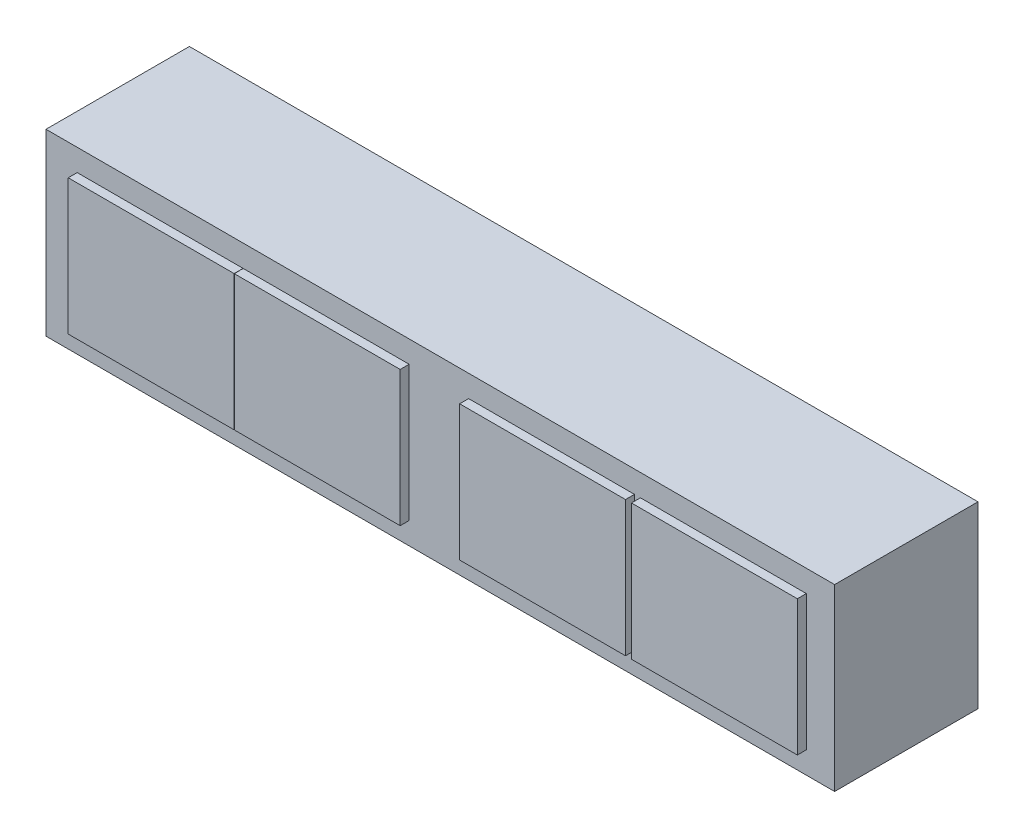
from build123d import *

# Parameters (mm, degrees)
SKETCH1_W           = 1676.4
SKETCH1_H           = 381
BOSS_EXTRUDE1_DEPTH = 304.8
SKETCH2_W           = 352.552609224
SKETCH2_H           = 287.715110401
BOSS_EXTRUDE2_DEPTH = 19.05


with BuildPart() as part:
    # Sketch1 → Boss-Extrude1 (new body)
    with BuildSketch(Plane.XY):
        with Locations((838.2, 190.5)):
            Rectangle(SKETCH1_W, SKETCH1_H)
    extrude(amount=BOSS_EXTRUDE1_DEPTH)

    # Sketch2 → Boss-Extrude2 (add)
    with BuildSketch(Plane.XY.offset(304.8)):
        with Locations((595.626304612, 190.494763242)):
            Rectangle(SKETCH2_W, SKETCH2_H)
        with Locations((242.573695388, 190.494763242)):
            Rectangle(SKETCH2_W, SKETCH2_H)
        with Locations((1074.673695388, 190.494763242)):
            Rectangle(SKETCH2_W, SKETCH2_H)
        with Locations((1439.926304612, 190.494763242)):
            Rectangle(SKETCH2_W, SKETCH2_H)
    extrude(amount=BOSS_EXTRUDE2_DEPTH)


solid = part.part
